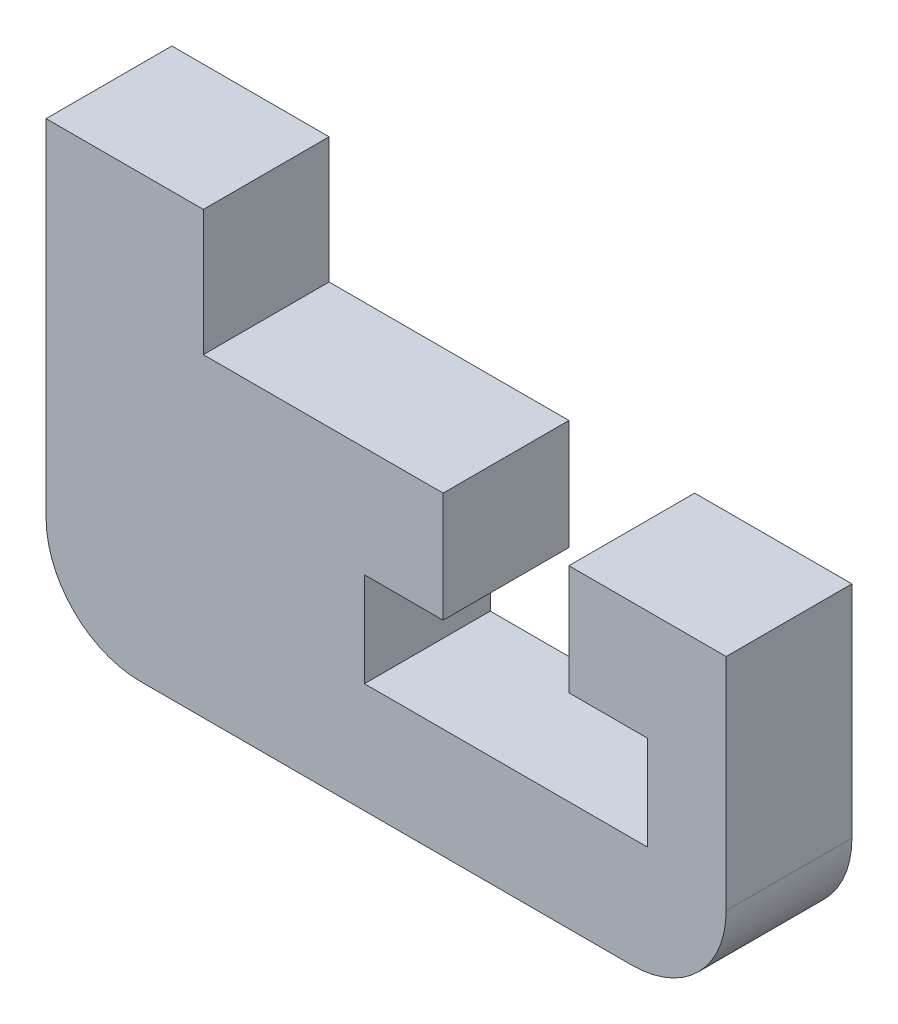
from build123d import *

# Parameters (mm, degrees)
SALIENTE_EXTRUIR1_DEPTH = 4


with BuildPart() as part:
    # Croquis1 → Saliente-Extruir1 (new body)
    with BuildSketch(Plane.XY):
        with BuildLine():
            Line((0, 23.001027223), (-5, 23.001027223))
            Line((-5, 23.001027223), (-5, 12.001027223))
            ThreePointArc((-5, 12.001027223), (-4.121320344, 9.87970688), (-2, 9.001027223))
            Line((-2, 9.001027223), (13.625, 9.001027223))
            ThreePointArc((13.625, 9.001027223), (15.746320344, 9.87970688), (16.625, 12.001027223))
            Line((16.625, 12.001027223), (16.625, 19.001027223))
            Line((16.625, 19.001027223), (11.625, 19.001027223))
            Line((11.625, 19.001027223), (11.625, 15.501027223))
            Line((11.625, 15.501027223), (14.125, 15.501027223))
            Line((14.125, 15.501027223), (14.125, 12.501027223))
            Line((14.125, 12.501027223), (5.125, 12.501027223))
            Line((5.125, 12.501027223), (5.125, 15.501027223))
            Line((5.125, 15.501027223), (7.625, 15.501027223))
            Line((7.625, 15.501027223), (7.625, 19.001027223))
            Line((7.625, 19.001027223), (0, 19.001027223))
            Line((0, 19.001027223), (0, 23.001027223))
        make_face()
    extrude(amount=SALIENTE_EXTRUIR1_DEPTH)


solid = part.part
